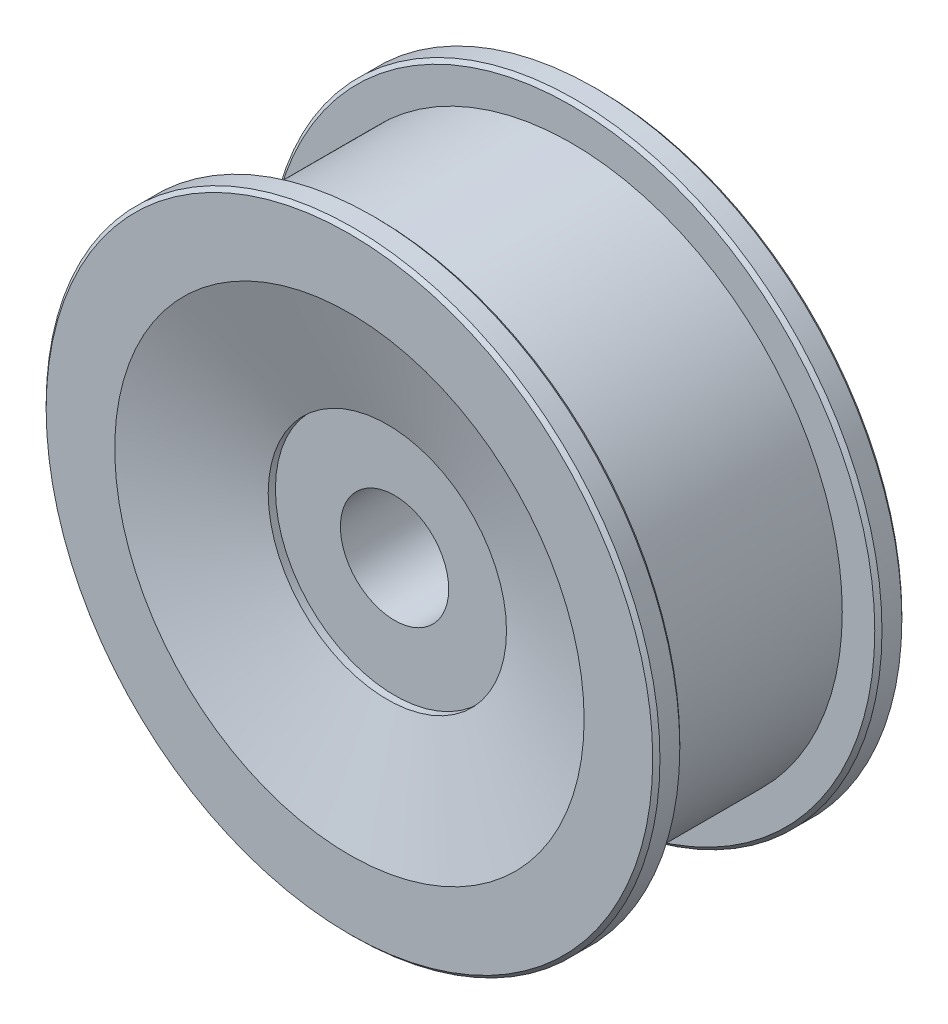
ISO-10303-21;
HEADER;
FILE_DESCRIPTION(('STEP AP214'),'2;1');
FILE_NAME('part.step','',(''),(''),'','','');
FILE_SCHEMA(('AUTOMOTIVE_DESIGN { 1 0 10303 214 1 1 1 1 }'));
ENDSEC;
DATA;
#1=APPLICATION_CONTEXT('core data for automotive mechanical design processes');
#2=APPLICATION_PROTOCOL_DEFINITION('international standard','automotive_design',2000,#1);
#3=PRODUCT_CONTEXT('',#1,'mechanical');
#4=PRODUCT('Part','Part','',(#3));
#5=PRODUCT_RELATED_PRODUCT_CATEGORY('part','',(#4));
#6=PRODUCT_DEFINITION_FORMATION('','',#4);
#7=PRODUCT_DEFINITION_CONTEXT('part definition',#1,'design');
#8=PRODUCT_DEFINITION('design','',#6,#7);
#9=PRODUCT_DEFINITION_SHAPE('','',#8);
#10=(LENGTH_UNIT() NAMED_UNIT(*) SI_UNIT(.MILLI.,.METRE.));
#11=(NAMED_UNIT(*) PLANE_ANGLE_UNIT() SI_UNIT($,.RADIAN.));
#12=(NAMED_UNIT(*) SI_UNIT($,.STERADIAN.) SOLID_ANGLE_UNIT());
#13=UNCERTAINTY_MEASURE_WITH_UNIT(LENGTH_MEASURE(1.E-05),#10,'distance_accuracy_value','');
#14=(GEOMETRIC_REPRESENTATION_CONTEXT(3) GLOBAL_UNCERTAINTY_ASSIGNED_CONTEXT((#13)) GLOBAL_UNIT_ASSIGNED_CONTEXT((#10,
#11,#12)) REPRESENTATION_CONTEXT('',''));
#15=CARTESIAN_POINT('',(0.,0.,0.));
#16=DIRECTION('',(0.,0.,1.));
#17=DIRECTION('',(1.,0.,0.));
#18=AXIS2_PLACEMENT_3D('',#15,#16,#17);
#19=CARTESIAN_POINT('',(0.,-7.5,-11.));
#20=DIRECTION('',(0.,0.,-1.));
#21=DIRECTION('',(1.,0.,0.));
#22=AXIS2_PLACEMENT_3D('',#19,#20,#21);
#23=PLANE('',#22);
#24=CARTESIAN_POINT('',(0.,0.,-11.));
#25=DIRECTION('',(0.,0.,-1.));
#26=DIRECTION('',(1.,0.,0.));
#27=AXIS2_PLACEMENT_3D('',#24,#25,#26);
#28=CIRCLE('',#27,16.5);
#29=CARTESIAN_POINT('',(16.5,0.,-11.));
#30=VERTEX_POINT('',#29);
#31=EDGE_CURVE('E71',#30,#30,#28,.T.);
#32=ORIENTED_EDGE('',*,*,#31,.T.);
#33=EDGE_LOOP('',(#32));
#34=FACE_BOUND('',#33,.T.);
#35=CARTESIAN_POINT('',(0.,0.,-11.));
#36=DIRECTION('',(0.,0.,-1.));
#37=DIRECTION('',(1.,0.,0.));
#38=AXIS2_PLACEMENT_3D('',#35,#36,#37);
#39=CIRCLE('',#38,7.5);
#40=CARTESIAN_POINT('',(7.5,0.,-11.));
#41=VERTEX_POINT('',#40);
#42=EDGE_CURVE('E44',#41,#41,#39,.T.);
#43=ORIENTED_EDGE('',*,*,#42,.F.);
#44=EDGE_LOOP('',(#43));
#45=FACE_BOUND('',#44,.T.);
#46=ADVANCED_FACE('F12',(#34,#45),#23,.T.);
#47=CARTESIAN_POINT('',(0.,0.,-20.));
#48=DIRECTION('',(0.,0.,-1.));
#49=DIRECTION('',(1.,0.,0.));
#50=AXIS2_PLACEMENT_3D('',#47,#48,#49);
#51=CYLINDRICAL_SURFACE('',#50,7.5);
#52=ORIENTED_EDGE('',*,*,#42,.T.);
#53=EDGE_LOOP('',(#52));
#54=FACE_BOUND('',#53,.T.);
#55=CARTESIAN_POINT('',(0.,0.,11.));
#56=DIRECTION('',(0.,0.,-1.));
#57=DIRECTION('',(1.,0.,0.));
#58=AXIS2_PLACEMENT_3D('',#55,#56,#57);
#59=CIRCLE('',#58,7.5);
#60=CARTESIAN_POINT('',(7.5,0.,11.));
#61=VERTEX_POINT('',#60);
#62=EDGE_CURVE('E47',#61,#61,#59,.T.);
#63=ORIENTED_EDGE('',*,*,#62,.F.);
#64=EDGE_LOOP('',(#63));
#65=FACE_BOUND('',#64,.T.);
#66=ADVANCED_FACE('F96',(#54,#65),#51,.F.);
#67=CARTESIAN_POINT('',(0.,-7.5,11.));
#68=DIRECTION('',(0.,0.,-1.));
#69=DIRECTION('',(1.,0.,0.));
#70=AXIS2_PLACEMENT_3D('',#67,#68,#69);
#71=PLANE('',#70);
#72=CARTESIAN_POINT('',(0.,0.,11.));
#73=DIRECTION('',(0.,0.,-1.));
#74=DIRECTION('',(1.,0.,0.));
#75=AXIS2_PLACEMENT_3D('',#72,#73,#74);
#76=CIRCLE('',#75,16.5);
#77=CARTESIAN_POINT('',(16.5,0.,11.));
#78=VERTEX_POINT('',#77);
#79=EDGE_CURVE('E50',#78,#78,#76,.T.);
#80=ORIENTED_EDGE('',*,*,#79,.F.);
#81=EDGE_LOOP('',(#80));
#82=FACE_BOUND('',#81,.T.);
#83=ORIENTED_EDGE('',*,*,#62,.T.);
#84=EDGE_LOOP('',(#83));
#85=FACE_BOUND('',#84,.T.);
#86=ADVANCED_FACE('F102',(#82,#85),#71,.F.);
#87=CARTESIAN_POINT('',(0.,0.,-20.));
#88=DIRECTION('',(0.,0.,-1.));
#89=DIRECTION('',(1.,0.,0.));
#90=AXIS2_PLACEMENT_3D('',#87,#88,#89);
#91=CYLINDRICAL_SURFACE('',#90,16.5);
#92=CARTESIAN_POINT('',(0.,0.,12.));
#93=DIRECTION('',(0.,0.,-1.));
#94=DIRECTION('',(1.,0.,0.));
#95=AXIS2_PLACEMENT_3D('',#92,#93,#94);
#96=CIRCLE('',#95,16.5);
#97=CARTESIAN_POINT('',(16.5,0.,12.));
#98=VERTEX_POINT('',#97);
#99=EDGE_CURVE('E53',#98,#98,#96,.T.);
#100=ORIENTED_EDGE('',*,*,#99,.F.);
#101=EDGE_LOOP('',(#100));
#102=FACE_BOUND('',#101,.T.);
#103=ORIENTED_EDGE('',*,*,#79,.T.);
#104=EDGE_LOOP('',(#103));
#105=FACE_BOUND('',#104,.T.);
#106=ADVANCED_FACE('F141',(#102,#105),#91,.F.);
#107=CARTESIAN_POINT('',(0.,0.,12.));
#108=DIRECTION('',(0.,0.,1.));
#109=DIRECTION('',(-1.,0.,0.));
#110=AXIS2_PLACEMENT_3D('',#107,#108,#109);
#111=CONICAL_SURFACE('',#110,16.5,1.25374057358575);
#112=CARTESIAN_POINT('',(0.,0.,17.25));
#113=DIRECTION('',(0.,0.,-1.));
#114=DIRECTION('',(1.,0.,0.));
#115=AXIS2_PLACEMENT_3D('',#112,#113,#114);
#116=CIRCLE('',#115,32.5);
#117=CARTESIAN_POINT('',(32.5,0.,17.25));
#118=VERTEX_POINT('',#117);
#119=EDGE_CURVE('E56',#118,#118,#116,.T.);
#120=ORIENTED_EDGE('',*,*,#119,.F.);
#121=EDGE_LOOP('',(#120));
#122=FACE_BOUND('',#121,.T.);
#123=ORIENTED_EDGE('',*,*,#99,.T.);
#124=EDGE_LOOP('',(#123));
#125=FACE_BOUND('',#124,.T.);
#126=ADVANCED_FACE('F135',(#122,#125),#111,.F.);
#127=CARTESIAN_POINT('',(0.,-42.5,17.25));
#128=DIRECTION('',(0.,0.,1.));
#129=DIRECTION('',(-1.,0.,0.));
#130=AXIS2_PLACEMENT_3D('',#127,#128,#129);
#131=PLANE('',#130);
#132=CARTESIAN_POINT('',(0.,0.,17.25));
#133=DIRECTION('',(0.,0.,1.));
#134=DIRECTION('',(1.,0.,0.));
#135=AXIS2_PLACEMENT_3D('',#132,#133,#134);
#136=CIRCLE('',#135,42.);
#137=CARTESIAN_POINT('',(42.,0.,17.25));
#138=VERTEX_POINT('',#137);
#139=EDGE_CURVE('E19',#138,#138,#136,.T.);
#140=ORIENTED_EDGE('',*,*,#139,.T.);
#141=EDGE_LOOP('',(#140));
#142=FACE_BOUND('',#141,.T.);
#143=ORIENTED_EDGE('',*,*,#119,.T.);
#144=EDGE_LOOP('',(#143));
#145=FACE_BOUND('',#144,.T.);
#146=ADVANCED_FACE('F124',(#142,#145),#131,.T.);
#147=CARTESIAN_POINT('',(0.,0.,-20.));
#148=DIRECTION('',(0.,0.,-1.));
#149=DIRECTION('',(1.,0.,0.));
#150=AXIS2_PLACEMENT_3D('',#147,#148,#149);
#151=CYLINDRICAL_SURFACE('',#150,42.5);
#152=CARTESIAN_POINT('',(0.,0.,16.75));
#153=DIRECTION('',(0.,0.,1.));
#154=DIRECTION('',(1.,0.,0.));
#155=AXIS2_PLACEMENT_3D('',#152,#153,#154);
#156=CIRCLE('',#155,42.5);
#157=CARTESIAN_POINT('',(42.5,0.,16.75));
#158=VERTEX_POINT('',#157);
#159=EDGE_CURVE('E23',#158,#158,#156,.F.);
#160=ORIENTED_EDGE('',*,*,#159,.T.);
#161=EDGE_LOOP('',(#160));
#162=FACE_BOUND('',#161,.T.);
#163=CARTESIAN_POINT('',(0.,0.,14.));
#164=DIRECTION('',(0.,0.,1.));
#165=DIRECTION('',(1.,0.,0.));
#166=AXIS2_PLACEMENT_3D('',#163,#164,#165);
#167=CIRCLE('',#166,42.5);
#168=CARTESIAN_POINT('',(42.5,0.,14.));
#169=VERTEX_POINT('',#168);
#170=EDGE_CURVE('E27',#169,#169,#167,.T.);
#171=ORIENTED_EDGE('',*,*,#170,.T.);
#172=EDGE_LOOP('',(#171));
#173=FACE_BOUND('',#172,.T.);
#174=ADVANCED_FACE('F120',(#162,#173),#151,.T.);
#175=CARTESIAN_POINT('',(0.,-42.5,13.5));
#176=DIRECTION('',(0.,0.,1.));
#177=DIRECTION('',(-1.,0.,0.));
#178=AXIS2_PLACEMENT_3D('',#175,#176,#177);
#179=PLANE('',#178);
#180=CARTESIAN_POINT('',(0.,0.,13.5));
#181=DIRECTION('',(0.,0.,1.));
#182=DIRECTION('',(1.,0.,0.));
#183=AXIS2_PLACEMENT_3D('',#180,#181,#182);
#184=CIRCLE('',#183,42.);
#185=CARTESIAN_POINT('',(42.,0.,13.5));
#186=VERTEX_POINT('',#185);
#187=EDGE_CURVE('E8',#186,#186,#184,.F.);
#188=ORIENTED_EDGE('',*,*,#187,.T.);
#189=EDGE_LOOP('',(#188));
#190=FACE_BOUND('',#189,.T.);
#191=CARTESIAN_POINT('',(0.,0.,13.5));
#192=DIRECTION('',(0.,0.,-1.));
#193=DIRECTION('',(1.,0.,0.));
#194=AXIS2_PLACEMENT_3D('',#191,#192,#193);
#195=CIRCLE('',#194,37.5);
#196=CARTESIAN_POINT('',(37.5,0.,13.5));
#197=VERTEX_POINT('',#196);
#198=EDGE_CURVE('E59',#197,#197,#195,.T.);
#199=ORIENTED_EDGE('',*,*,#198,.F.);
#200=EDGE_LOOP('',(#199));
#201=FACE_BOUND('',#200,.T.);
#202=ADVANCED_FACE('F123',(#190,#201),#179,.F.);
#203=CARTESIAN_POINT('',(0.,0.,-20.));
#204=DIRECTION('',(0.,0.,-1.));
#205=DIRECTION('',(1.,0.,0.));
#206=AXIS2_PLACEMENT_3D('',#203,#204,#205);
#207=CYLINDRICAL_SURFACE('',#206,37.5);
#208=ORIENTED_EDGE('',*,*,#198,.T.);
#209=EDGE_LOOP('',(#208));
#210=FACE_BOUND('',#209,.T.);
#211=CARTESIAN_POINT('',(0.,0.,-13.5));
#212=DIRECTION('',(0.,0.,-1.));
#213=DIRECTION('',(1.,0.,0.));
#214=AXIS2_PLACEMENT_3D('',#211,#212,#213);
#215=CIRCLE('',#214,37.5);
#216=CARTESIAN_POINT('',(37.5,0.,-13.5));
#217=VERTEX_POINT('',#216);
#218=EDGE_CURVE('E62',#217,#217,#215,.T.);
#219=ORIENTED_EDGE('',*,*,#218,.F.);
#220=EDGE_LOOP('',(#219));
#221=FACE_BOUND('',#220,.T.);
#222=ADVANCED_FACE('F133',(#210,#221),#207,.T.);
#223=CARTESIAN_POINT('',(0.,-42.5,-13.5));
#224=DIRECTION('',(0.,0.,1.));
#225=DIRECTION('',(-1.,0.,0.));
#226=AXIS2_PLACEMENT_3D('',#223,#224,#225);
#227=PLANE('',#226);
#228=CARTESIAN_POINT('',(0.,0.,-13.5));
#229=DIRECTION('',(0.,0.,1.));
#230=DIRECTION('',(1.,0.,0.));
#231=AXIS2_PLACEMENT_3D('',#228,#229,#230);
#232=CIRCLE('',#231,42.);
#233=CARTESIAN_POINT('',(42.,0.,-13.5));
#234=VERTEX_POINT('',#233);
#235=EDGE_CURVE('E32',#234,#234,#232,.T.);
#236=ORIENTED_EDGE('',*,*,#235,.T.);
#237=EDGE_LOOP('',(#236));
#238=FACE_BOUND('',#237,.T.);
#239=ORIENTED_EDGE('',*,*,#218,.T.);
#240=EDGE_LOOP('',(#239));
#241=FACE_BOUND('',#240,.T.);
#242=ADVANCED_FACE('F245',(#238,#241),#227,.T.);
#243=CARTESIAN_POINT('',(0.,0.,-20.));
#244=DIRECTION('',(0.,0.,-1.));
#245=DIRECTION('',(1.,0.,0.));
#246=AXIS2_PLACEMENT_3D('',#243,#244,#245);
#247=CYLINDRICAL_SURFACE('',#246,42.5);
#248=CARTESIAN_POINT('',(0.,0.,-16.75));
#249=DIRECTION('',(0.,0.,1.));
#250=DIRECTION('',(1.,0.,0.));
#251=AXIS2_PLACEMENT_3D('',#248,#249,#250);
#252=CIRCLE('',#251,42.5);
#253=CARTESIAN_POINT('',(42.5,0.,-16.75));
#254=VERTEX_POINT('',#253);
#255=EDGE_CURVE('E35',#254,#254,#252,.T.);
#256=ORIENTED_EDGE('',*,*,#255,.T.);
#257=EDGE_LOOP('',(#256));
#258=FACE_BOUND('',#257,.T.);
#259=CARTESIAN_POINT('',(0.,0.,-14.));
#260=DIRECTION('',(0.,0.,1.));
#261=DIRECTION('',(1.,0.,0.));
#262=AXIS2_PLACEMENT_3D('',#259,#260,#261);
#263=CIRCLE('',#262,42.5);
#264=CARTESIAN_POINT('',(42.5,0.,-14.));
#265=VERTEX_POINT('',#264);
#266=EDGE_CURVE('E38',#265,#265,#263,.F.);
#267=ORIENTED_EDGE('',*,*,#266,.T.);
#268=EDGE_LOOP('',(#267));
#269=FACE_BOUND('',#268,.T.);
#270=ADVANCED_FACE('F237',(#258,#269),#247,.T.);
#271=CARTESIAN_POINT('',(0.,-42.5,-17.25));
#272=DIRECTION('',(0.,0.,1.));
#273=DIRECTION('',(-1.,0.,0.));
#274=AXIS2_PLACEMENT_3D('',#271,#272,#273);
#275=PLANE('',#274);
#276=CARTESIAN_POINT('',(0.,0.,-17.25));
#277=DIRECTION('',(0.,0.,1.));
#278=DIRECTION('',(1.,0.,0.));
#279=AXIS2_PLACEMENT_3D('',#276,#277,#278);
#280=CIRCLE('',#279,42.);
#281=CARTESIAN_POINT('',(42.,0.,-17.25));
#282=VERTEX_POINT('',#281);
#283=EDGE_CURVE('E41',#282,#282,#280,.F.);
#284=ORIENTED_EDGE('',*,*,#283,.T.);
#285=EDGE_LOOP('',(#284));
#286=FACE_BOUND('',#285,.T.);
#287=CARTESIAN_POINT('',(0.,0.,-17.25));
#288=DIRECTION('',(0.,0.,-1.));
#289=DIRECTION('',(1.,0.,0.));
#290=AXIS2_PLACEMENT_3D('',#287,#288,#289);
#291=CIRCLE('',#290,32.5);
#292=CARTESIAN_POINT('',(32.5,0.,-17.25));
#293=VERTEX_POINT('',#292);
#294=EDGE_CURVE('E65',#293,#293,#291,.T.);
#295=ORIENTED_EDGE('',*,*,#294,.F.);
#296=EDGE_LOOP('',(#295));
#297=FACE_BOUND('',#296,.T.);
#298=ADVANCED_FACE('F92',(#286,#297),#275,.F.);
#299=CARTESIAN_POINT('',(0.,0.,-12.));
#300=DIRECTION('',(0.,0.,-1.));
#301=DIRECTION('',(1.,0.,0.));
#302=AXIS2_PLACEMENT_3D('',#299,#300,#301);
#303=CONICAL_SURFACE('',#302,16.5,1.25374057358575);
#304=ORIENTED_EDGE('',*,*,#294,.T.);
#305=EDGE_LOOP('',(#304));
#306=FACE_BOUND('',#305,.T.);
#307=CARTESIAN_POINT('',(0.,0.,-12.));
#308=DIRECTION('',(0.,0.,-1.));
#309=DIRECTION('',(1.,0.,0.));
#310=AXIS2_PLACEMENT_3D('',#307,#308,#309);
#311=CIRCLE('',#310,16.5);
#312=CARTESIAN_POINT('',(16.5,0.,-12.));
#313=VERTEX_POINT('',#312);
#314=EDGE_CURVE('E68',#313,#313,#311,.T.);
#315=ORIENTED_EDGE('',*,*,#314,.F.);
#316=EDGE_LOOP('',(#315));
#317=FACE_BOUND('',#316,.T.);
#318=ADVANCED_FACE('F80',(#306,#317),#303,.F.);
#319=CARTESIAN_POINT('',(0.,0.,-20.));
#320=DIRECTION('',(0.,0.,-1.));
#321=DIRECTION('',(1.,0.,0.));
#322=AXIS2_PLACEMENT_3D('',#319,#320,#321);
#323=CYLINDRICAL_SURFACE('',#322,16.5);
#324=ORIENTED_EDGE('',*,*,#314,.T.);
#325=EDGE_LOOP('',(#324));
#326=FACE_BOUND('',#325,.T.);
#327=ORIENTED_EDGE('',*,*,#31,.F.);
#328=EDGE_LOOP('',(#327));
#329=FACE_BOUND('',#328,.T.);
#330=ADVANCED_FACE('F77',(#326,#329),#323,.F.);
#331=CARTESIAN_POINT('',(0.,0.,-17.25));
#332=DIRECTION('',(0.,0.,1.));
#333=DIRECTION('',(1.,0.,0.));
#334=AXIS2_PLACEMENT_3D('',#331,#332,#333);
#335=CONICAL_SURFACE('',#334,42.,0.785398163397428);
#336=ORIENTED_EDGE('',*,*,#255,.F.);
#337=EDGE_LOOP('',(#336));
#338=FACE_BOUND('',#337,.T.);
#339=ORIENTED_EDGE('',*,*,#283,.F.);
#340=EDGE_LOOP('',(#339));
#341=FACE_BOUND('',#340,.T.);
#342=ADVANCED_FACE('F79',(#338,#341),#335,.T.);
#343=CARTESIAN_POINT('',(0.,0.,-14.));
#344=DIRECTION('',(0.,0.,-1.));
#345=DIRECTION('',(-1.,0.,0.));
#346=AXIS2_PLACEMENT_3D('',#343,#344,#345);
#347=CONICAL_SURFACE('',#346,42.5,0.785398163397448);
#348=ORIENTED_EDGE('',*,*,#235,.F.);
#349=EDGE_LOOP('',(#348));
#350=FACE_BOUND('',#349,.T.);
#351=ORIENTED_EDGE('',*,*,#266,.F.);
#352=EDGE_LOOP('',(#351));
#353=FACE_BOUND('',#352,.T.);
#354=ADVANCED_FACE('F89',(#350,#353),#347,.T.);
#355=CARTESIAN_POINT('',(0.,0.,16.75));
#356=DIRECTION('',(0.,0.,-1.));
#357=DIRECTION('',(-1.,0.,0.));
#358=AXIS2_PLACEMENT_3D('',#355,#356,#357);
#359=CONICAL_SURFACE('',#358,42.5,0.785398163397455);
#360=ORIENTED_EDGE('',*,*,#139,.F.);
#361=EDGE_LOOP('',(#360));
#362=FACE_BOUND('',#361,.T.);
#363=ORIENTED_EDGE('',*,*,#159,.F.);
#364=EDGE_LOOP('',(#363));
#365=FACE_BOUND('',#364,.T.);
#366=ADVANCED_FACE('F108',(#362,#365),#359,.T.);
#367=CARTESIAN_POINT('',(0.,0.,13.5));
#368=DIRECTION('',(0.,0.,1.));
#369=DIRECTION('',(1.,0.,0.));
#370=AXIS2_PLACEMENT_3D('',#367,#368,#369);
#371=CONICAL_SURFACE('',#370,42.,0.785398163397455);
#372=ORIENTED_EDGE('',*,*,#170,.F.);
#373=EDGE_LOOP('',(#372));
#374=FACE_BOUND('',#373,.T.);
#375=ORIENTED_EDGE('',*,*,#187,.F.);
#376=EDGE_LOOP('',(#375));
#377=FACE_BOUND('',#376,.T.);
#378=ADVANCED_FACE('F14',(#374,#377),#371,.T.);
#379=CLOSED_SHELL('',(#46,#66,#86,#106,#126,#146,#174,#202,#222,#242,#270,#298,#318,#330,#342,
#354,#366,#378));
#380=MANIFOLD_SOLID_BREP('B1',#379);
#381=ADVANCED_BREP_SHAPE_REPRESENTATION('',(#18,#380),#14);
#382=SHAPE_DEFINITION_REPRESENTATION(#9,#381);
ENDSEC;
END-ISO-10303-21;
